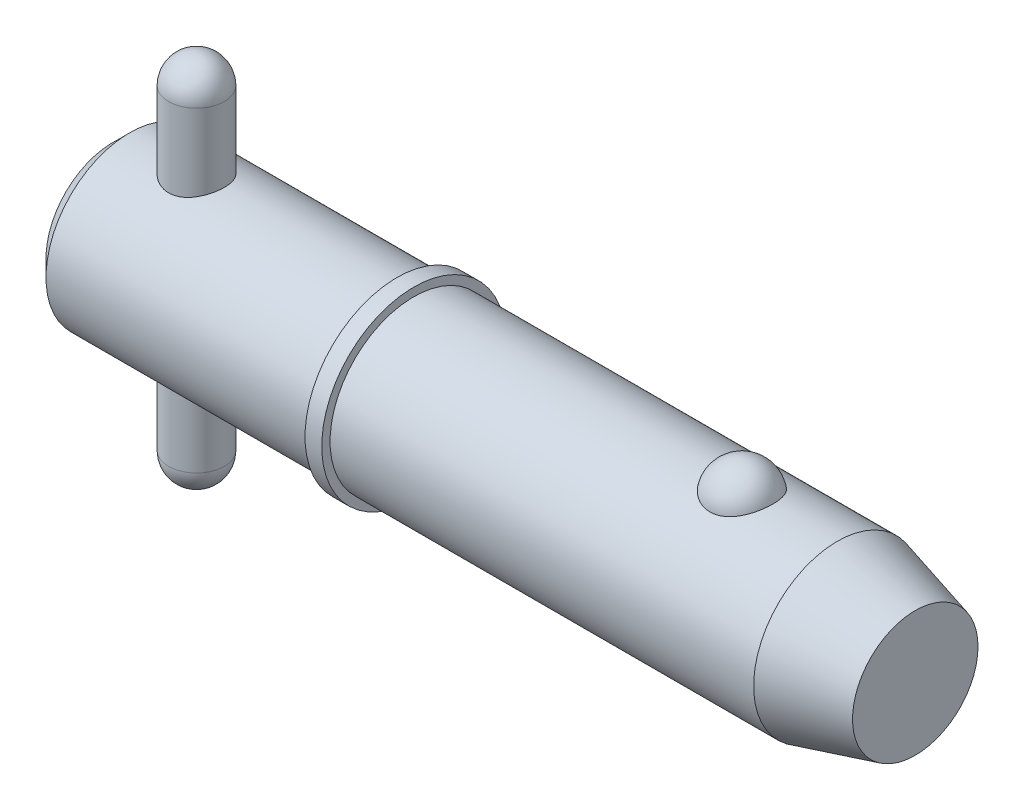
ISO-10303-21;
HEADER;
FILE_DESCRIPTION(('STEP AP214'),'2;1');
FILE_NAME('part.step','',(''),(''),'','','');
FILE_SCHEMA(('AUTOMOTIVE_DESIGN { 1 0 10303 214 1 1 1 1 }'));
ENDSEC;
DATA;
#1=APPLICATION_CONTEXT('core data for automotive mechanical design processes');
#2=APPLICATION_PROTOCOL_DEFINITION('international standard','automotive_design',2000,#1);
#3=PRODUCT_CONTEXT('',#1,'mechanical');
#4=PRODUCT('Part','Part','',(#3));
#5=PRODUCT_RELATED_PRODUCT_CATEGORY('part','',(#4));
#6=PRODUCT_DEFINITION_FORMATION('','',#4);
#7=PRODUCT_DEFINITION_CONTEXT('part definition',#1,'design');
#8=PRODUCT_DEFINITION('design','',#6,#7);
#9=PRODUCT_DEFINITION_SHAPE('','',#8);
#10=(LENGTH_UNIT() NAMED_UNIT(*) SI_UNIT(.MILLI.,.METRE.));
#11=(NAMED_UNIT(*) PLANE_ANGLE_UNIT() SI_UNIT($,.RADIAN.));
#12=(NAMED_UNIT(*) SI_UNIT($,.STERADIAN.) SOLID_ANGLE_UNIT());
#13=UNCERTAINTY_MEASURE_WITH_UNIT(LENGTH_MEASURE(1.E-05),#10,'distance_accuracy_value','');
#14=(GEOMETRIC_REPRESENTATION_CONTEXT(3) GLOBAL_UNCERTAINTY_ASSIGNED_CONTEXT((#13)) GLOBAL_UNIT_ASSIGNED_CONTEXT((#10,
#11,#12)) REPRESENTATION_CONTEXT('',''));
#15=CARTESIAN_POINT('',(0.,0.,0.));
#16=DIRECTION('',(0.,0.,1.));
#17=DIRECTION('',(1.,0.,0.));
#18=AXIS2_PLACEMENT_3D('',#15,#16,#17);
#19=CARTESIAN_POINT('',(7.14,15.875,0.));
#20=DIRECTION('',(0.,-1.,0.));
#21=DIRECTION('',(0.,0.,-1.));
#22=AXIS2_PLACEMENT_3D('',#19,#20,#21);
#23=CYLINDRICAL_SURFACE('',#22,2.38);
#24=CARTESIAN_POINT('',(7.14,-13.495,0.));
#25=DIRECTION('',(0.,-1.,0.));
#26=DIRECTION('',(0.,0.,-1.));
#27=AXIS2_PLACEMENT_3D('',#24,#25,#26);
#28=CIRCLE('',#27,2.38);
#29=CARTESIAN_POINT('',(7.14,-13.495,-2.38));
#30=VERTEX_POINT('',#29);
#31=EDGE_CURVE('P0_E10',#30,#30,#28,.F.);
#32=ORIENTED_EDGE('',*,*,#31,.T.);
#33=EDGE_LOOP('',(#32));
#34=FACE_BOUND('',#33,.T.);
#35=CARTESIAN_POINT('',(7.14,13.495,0.));
#36=DIRECTION('',(0.,-1.,0.));
#37=DIRECTION('',(0.,0.,-1.));
#38=AXIS2_PLACEMENT_3D('',#35,#36,#37);
#39=CIRCLE('',#38,2.38);
#40=CARTESIAN_POINT('',(7.14,13.495,-2.38));
#41=VERTEX_POINT('',#40);
#42=EDGE_CURVE('P0_E21',#41,#41,#39,.T.);
#43=ORIENTED_EDGE('',*,*,#42,.T.);
#44=EDGE_LOOP('',(#43));
#45=FACE_BOUND('',#44,.T.);
#46=ADVANCED_FACE('P0_F14',(#34,#45),#23,.T.);
#47=CARTESIAN_POINT('',(7.14,-13.495,0.));
#48=DIRECTION('',(0.,0.,1.));
#49=DIRECTION('',(1.,0.,0.));
#50=AXIS2_PLACEMENT_3D('',#47,#48,#49);
#51=SPHERICAL_SURFACE('',#50,2.38);
#52=CARTESIAN_POINT('',(7.14,-13.495,0.));
#53=DIRECTION('',(0.,-1.,0.));
#54=DIRECTION('',(0.,0.,-1.));
#55=AXIS2_PLACEMENT_3D('',#52,#53,#54);
#56=SPHERICAL_SURFACE('',#55,2.38);
#57=ORIENTED_EDGE('',*,*,#31,.F.);
#58=EDGE_LOOP('',(#57));
#59=FACE_BOUND('',#58,.T.);
#60=ADVANCED_FACE('P0_F29',(#59),#56,.T.);
#61=CARTESIAN_POINT('',(7.14,13.495,0.));
#62=DIRECTION('',(0.,0.,1.));
#63=DIRECTION('',(1.,0.,0.));
#64=AXIS2_PLACEMENT_3D('',#61,#62,#63);
#65=SPHERICAL_SURFACE('',#64,2.38);
#66=CARTESIAN_POINT('',(7.14,13.495,0.));
#67=DIRECTION('',(0.,-1.,0.));
#68=DIRECTION('',(0.,0.,-1.));
#69=AXIS2_PLACEMENT_3D('',#66,#67,#68);
#70=SPHERICAL_SURFACE('',#69,2.38);
#71=ORIENTED_EDGE('',*,*,#42,.F.);
#72=EDGE_LOOP('',(#71));
#73=FACE_BOUND('',#72,.T.);
#74=ADVANCED_FACE('P0_F16',(#73),#70,.T.);
#75=CLOSED_SHELL('',(#46,#60,#74));
#76=MANIFOLD_SOLID_BREP('P0_B1',#75);
#77=CARTESIAN_POINT('',(0.,0.,0.));
#78=DIRECTION('',(1.,0.,0.));
#79=DIRECTION('',(0.,0.,-1.));
#80=AXIS2_PLACEMENT_3D('',#77,#78,#79);
#81=CYLINDRICAL_SURFACE('',#80,7.145);
#82=CARTESIAN_POINT('',(61.8836242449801,0.,0.));
#83=DIRECTION('',(1.,0.,0.));
#84=DIRECTION('',(0.,0.,-1.));
#85=AXIS2_PLACEMENT_3D('',#82,#83,#84);
#86=CIRCLE('',#85,7.145);
#87=CARTESIAN_POINT('',(61.8836242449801,0.,-7.145));
#88=VERTEX_POINT('',#87);
#89=EDGE_CURVE('P1_E81',#88,#88,#86,.T.);
#90=ORIENTED_EDGE('',*,*,#89,.F.);
#91=EDGE_LOOP('',(#90));
#92=FACE_BOUND('',#91,.T.);
#93=CARTESIAN_POINT('',(25.7,0.,0.));
#94=DIRECTION('',(1.,0.,0.));
#95=DIRECTION('',(0.,0.,-1.));
#96=AXIS2_PLACEMENT_3D('',#93,#94,#95);
#97=CIRCLE('',#96,7.145);
#98=CARTESIAN_POINT('',(25.7,0.,-7.145));
#99=VERTEX_POINT('',#98);
#100=EDGE_CURVE('P1_E85',#99,#99,#97,.T.);
#101=ORIENTED_EDGE('',*,*,#100,.T.);
#102=EDGE_LOOP('',(#101));
#103=FACE_BOUND('',#102,.T.);
#104=CARTESIAN_POINT('',(53.7395037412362,6.60328629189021,2.72903557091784));
#105=CARTESIAN_POINT('',(53.5983158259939,6.60329644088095,2.7290249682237));
#106=CARTESIAN_POINT('',(53.4568832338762,6.60799490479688,2.71772840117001));
#107=CARTESIAN_POINT('',(53.1779557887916,6.62628236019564,2.6728193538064));
#108=CARTESIAN_POINT('',(53.0404726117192,6.63989534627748,2.63914664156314));
#109=CARTESIAN_POINT('',(52.7738894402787,6.67440775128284,2.55059642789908));
#110=CARTESIAN_POINT('',(52.6447683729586,6.69528793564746,2.49577486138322));
#111=CARTESIAN_POINT('',(52.3978694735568,6.74205585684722,2.36651799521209));
#112=CARTESIAN_POINT('',(52.2800865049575,6.76794130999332,2.29209163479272));
#113=CARTESIAN_POINT('',(52.0551671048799,6.82286177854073,2.12312937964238));
#114=CARTESIAN_POINT('',(51.9484405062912,6.85196655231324,2.02807107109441));
#115=CARTESIAN_POINT('',(51.7519181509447,6.90970232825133,1.82167822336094));
#116=CARTESIAN_POINT('',(51.6621276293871,6.93833318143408,1.71033867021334));
#117=CARTESIAN_POINT('',(51.4976670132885,6.9935167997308,1.46891951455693));
#118=CARTESIAN_POINT('',(51.423844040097,7.01992110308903,1.33822781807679));
#119=CARTESIAN_POINT('',(51.2980884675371,7.06643385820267,1.0656656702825));
#120=CARTESIAN_POINT('',(51.2461573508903,7.08654188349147,0.923794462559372));
#121=CARTESIAN_POINT('',(51.1647323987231,7.11862399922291,0.630993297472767));
#122=CARTESIAN_POINT('',(51.1355167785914,7.13049704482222,0.479974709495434));
#123=CARTESIAN_POINT('',(51.1011742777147,7.14449484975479,0.174782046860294));
#124=CARTESIAN_POINT('',(51.0960466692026,7.14661990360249,0.0206080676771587));
#125=CARTESIAN_POINT('',(51.109938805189,7.14092465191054,-0.285506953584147));
#126=CARTESIAN_POINT('',(51.1288101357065,7.1331654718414,-0.437455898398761));
#127=CARTESIAN_POINT('',(51.1900622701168,7.10859076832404,-0.735778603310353));
#128=CARTESIAN_POINT('',(51.2324435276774,7.0917750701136,-0.882152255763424));
#129=CARTESIAN_POINT('',(51.3399346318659,7.05076716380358,-1.165431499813));
#130=CARTESIAN_POINT('',(51.4050759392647,7.02656475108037,-1.30232366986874));
#131=CARTESIAN_POINT('',(51.5567597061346,6.97329145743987,-1.56265907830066));
#132=CARTESIAN_POINT('',(51.643303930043,6.94422017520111,-1.68610120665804));
#133=CARTESIAN_POINT('',(51.8364654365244,6.88415108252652,-1.91671004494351));
#134=CARTESIAN_POINT('',(51.9431807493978,6.85314438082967,-2.02379244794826));
#135=CARTESIAN_POINT('',(52.1739740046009,6.79282069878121,-2.21787433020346));
#136=CARTESIAN_POINT('',(52.2980505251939,6.76350358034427,-2.30487545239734));
#137=CARTESIAN_POINT('',(52.5576784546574,6.71060580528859,-2.45458647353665));
#138=CARTESIAN_POINT('',(52.6929387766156,6.68691885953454,-2.51776240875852));
#139=CARTESIAN_POINT('',(52.9732778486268,6.64741247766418,-2.62030218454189));
#140=CARTESIAN_POINT('',(53.1183528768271,6.63159007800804,-2.65967499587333));
#141=CARTESIAN_POINT('',(53.4063475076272,6.61038594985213,-2.71193301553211));
#142=CARTESIAN_POINT('',(53.5490080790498,6.60451880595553,-2.72605165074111));
#143=CARTESIAN_POINT('',(53.8348004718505,6.60240611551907,-2.73116688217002));
#144=CARTESIAN_POINT('',(53.9779321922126,6.60615862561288,-2.72216814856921));
#145=CARTESIAN_POINT('',(54.2558486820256,6.6225609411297,-2.68200435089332));
#146=CARTESIAN_POINT('',(54.3907542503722,6.63492533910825,-2.65154998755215));
#147=CARTESIAN_POINT('',(54.65332009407,6.66687445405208,-2.57015684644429));
#148=CARTESIAN_POINT('',(54.7809797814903,6.68645975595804,-2.51921640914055));
#149=CARTESIAN_POINT('',(55.0285777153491,6.73127274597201,-2.39693610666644));
#150=CARTESIAN_POINT('',(55.148287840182,6.7566138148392,-2.32517694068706));
#151=CARTESIAN_POINT('',(55.3741592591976,6.8100600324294,-2.16363812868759));
#152=CARTESIAN_POINT('',(55.480317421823,6.83816581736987,-2.07385432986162));
#153=CARTESIAN_POINT('',(55.6818620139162,6.89580469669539,-1.87357235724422));
#154=CARTESIAN_POINT('',(55.776440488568,6.92533863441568,-1.76226074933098));
#155=CARTESIAN_POINT('',(55.9463329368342,6.98139526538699,-1.52511696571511));
#156=CARTESIAN_POINT('',(56.0216434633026,7.0079174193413,-1.39928219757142));
#157=CARTESIAN_POINT('',(56.153595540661,7.05607625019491,-1.1321597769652));
#158=CARTESIAN_POINT('',(56.2095688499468,7.07753119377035,-0.990508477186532));
#159=CARTESIAN_POINT('',(56.2982965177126,7.11222355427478,-0.699154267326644));
#160=CARTESIAN_POINT('',(56.3310506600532,7.12546089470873,-0.549451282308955));
#161=CARTESIAN_POINT('',(56.3726899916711,7.14237584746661,-0.246120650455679));
#162=CARTESIAN_POINT('',(56.381558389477,7.14604673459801,-0.0924903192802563));
#163=CARTESIAN_POINT('',(56.3751940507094,7.14343510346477,0.214181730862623));
#164=CARTESIAN_POINT('',(56.3599618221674,7.13715279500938,0.367223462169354));
#165=CARTESIAN_POINT('',(56.3058451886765,7.1153294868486,0.667595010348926));
#166=CARTESIAN_POINT('',(56.2670776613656,7.09983424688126,0.814949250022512));
#167=CARTESIAN_POINT('',(56.1667700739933,7.06119140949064,1.10063221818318));
#168=CARTESIAN_POINT('',(56.1052284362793,7.03804328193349,1.238960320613));
#169=CARTESIAN_POINT('',(55.9602071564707,6.98632429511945,1.50352300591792));
#170=CARTESIAN_POINT('',(55.8766067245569,6.95772382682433,1.62968561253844));
#171=CARTESIAN_POINT('',(55.6893804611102,6.89823072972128,1.86554304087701));
#172=CARTESIAN_POINT('',(55.5857557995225,6.86733823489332,1.97523882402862));
#173=CARTESIAN_POINT('',(55.3610769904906,6.80676456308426,2.17482293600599));
#174=CARTESIAN_POINT('',(55.2400673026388,6.7770805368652,2.26476035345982));
#175=CARTESIAN_POINT('',(54.9833408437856,6.7223050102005,2.42252989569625));
#176=CARTESIAN_POINT('',(54.84761851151,6.69721525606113,2.49035362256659));
#177=CARTESIAN_POINT('',(54.5704022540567,6.65552591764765,2.59967646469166));
#178=CARTESIAN_POINT('',(54.4292810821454,6.63865794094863,2.64202017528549));
#179=CARTESIAN_POINT('',(54.1414448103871,6.61425039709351,2.7025584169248));
#180=CARTESIAN_POINT('',(53.9947480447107,6.606682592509,2.72082606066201));
#181=CARTESIAN_POINT('',(53.8116799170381,6.60358754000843,2.72830331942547));
#182=CARTESIAN_POINT('',(53.7755998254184,6.60328369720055,2.72903828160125));
#183=CARTESIAN_POINT('',(53.7395037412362,6.60328629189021,2.72903557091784));
#184=B_SPLINE_CURVE_WITH_KNOTS('',3,(#104,#105,#106,#107,#108,#109,#110,#111,#112,#113,#114,
#115,#116,#117,#118,#119,#120,#121,#122,#123,#124,#125,#126,#127,#128,#129,#130,#131,#132,#133,
#134,#135,#136,#137,#138,#139,#140,#141,#142,#143,#144,#145,#146,#147,#148,#149,#150,#151,#152,
#153,#154,#155,#156,#157,#158,#159,#160,#161,#162,#163,#164,#165,#166,#167,#168,#169,#170,#171,
#172,#173,#174,#175,#176,#177,#178,#179,#180,#181,#182,#183),.UNSPECIFIED.,.T.,.F.,(4,2,2,2,2,2,
2,2,2,2,2,2,2,2,2,2,2,2,2,2,2,2,2,2,2,2,2,2,2,2,2,2,2,2,2,2,2,2,2,4),(0.,0.423468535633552,
0.848081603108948,1.27157926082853,1.69488414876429,2.13051395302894,2.56627819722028,
3.02136706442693,3.47648674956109,3.93709649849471,4.39769233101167,4.85545355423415,
5.31322361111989,5.77162895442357,6.23007210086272,6.69080337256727,7.15149693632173,
7.60264329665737,8.05361952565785,8.48189729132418,8.91008854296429,9.32472524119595,
9.73939553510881,10.1630783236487,10.5868588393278,11.0319070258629,11.4770347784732,
11.9362874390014,12.3955443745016,12.8551240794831,13.3146940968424,13.7720003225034,
14.2293382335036,14.6892343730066,15.1491036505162,15.6078171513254,16.0667046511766,
16.5093965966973,16.9507410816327,17.0590049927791),.UNSPECIFIED.);
#185=CARTESIAN_POINT('',(53.7395037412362,6.60328629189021,2.72903557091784));
#186=VERTEX_POINT('',#185);
#187=EDGE_CURVE('P1_E35',#186,#186,#184,.T.);
#188=ORIENTED_EDGE('',*,*,#187,.T.);
#189=EDGE_LOOP('',(#188));
#190=FACE_BOUND('',#189,.T.);
#191=ADVANCED_FACE('P1_F13',(#92,#103,#190),#81,.T.);
#192=CARTESIAN_POINT('',(0.,0.,0.));
#193=DIRECTION('',(-1.,0.,0.));
#194=DIRECTION('',(0.,0.,1.));
#195=AXIS2_PLACEMENT_3D('',#192,#193,#194);
#196=PLANE('',#195);
#197=CARTESIAN_POINT('',(0.,0.,0.));
#198=DIRECTION('',(1.,0.,0.));
#199=DIRECTION('',(0.,0.,-1.));
#200=AXIS2_PLACEMENT_3D('',#197,#198,#199);
#201=CIRCLE('',#200,5.716);
#202=CARTESIAN_POINT('',(0.,0.,-5.716));
#203=VERTEX_POINT('',#202);
#204=EDGE_CURVE('P1_E9',#203,#203,#201,.T.);
#205=ORIENTED_EDGE('',*,*,#204,.F.);
#206=EDGE_LOOP('',(#205));
#207=FACE_BOUND('',#206,.T.);
#208=ADVANCED_FACE('P1_F15',(#207),#196,.T.);
#209=CARTESIAN_POINT('',(1.42899999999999,0.,0.));
#210=DIRECTION('',(1.,0.,0.));
#211=DIRECTION('',(0.,0.,-1.));
#212=AXIS2_PLACEMENT_3D('',#209,#210,#211);
#213=CONICAL_SURFACE('',#212,7.145,0.78539816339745);
#214=ORIENTED_EDGE('',*,*,#204,.T.);
#215=EDGE_LOOP('',(#214));
#216=FACE_BOUND('',#215,.T.);
#217=CARTESIAN_POINT('',(1.42899999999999,0.,0.));
#218=DIRECTION('',(1.,0.,0.));
#219=DIRECTION('',(0.,0.,-1.));
#220=AXIS2_PLACEMENT_3D('',#217,#218,#219);
#221=CIRCLE('',#220,7.145);
#222=CARTESIAN_POINT('',(1.42899999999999,0.,-7.145));
#223=VERTEX_POINT('',#222);
#224=EDGE_CURVE('P1_E26',#223,#223,#221,.T.);
#225=ORIENTED_EDGE('',*,*,#224,.F.);
#226=EDGE_LOOP('',(#225));
#227=FACE_BOUND('',#226,.T.);
#228=ADVANCED_FACE('P1_F77',(#216,#227),#213,.T.);
#229=CARTESIAN_POINT('',(0.,0.,0.));
#230=DIRECTION('',(1.,0.,0.));
#231=DIRECTION('',(0.,0.,-1.));
#232=AXIS2_PLACEMENT_3D('',#229,#230,#231);
#233=CYLINDRICAL_SURFACE('',#232,7.145);
#234=CARTESIAN_POINT('',(7.14,-6.73695962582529,2.38));
#235=CARTESIAN_POINT('',(7.01035997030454,-6.73695921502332,2.38000059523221));
#236=CARTESIAN_POINT('',(6.88072348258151,-6.74074253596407,2.36937183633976));
#237=CARTESIAN_POINT('',(6.62529075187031,-6.75538853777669,2.32728080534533));
#238=CARTESIAN_POINT('',(6.49949514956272,-6.76625239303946,2.29581507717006));
#239=CARTESIAN_POINT('',(6.2554858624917,-6.79369535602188,2.21327763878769));
#240=CARTESIAN_POINT('',(6.13725786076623,-6.81026326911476,2.16224430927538));
#241=CARTESIAN_POINT('',(5.91100349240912,-6.84723128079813,2.04215132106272));
#242=CARTESIAN_POINT('',(5.80297937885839,-6.86763222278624,1.97308769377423));
#243=CARTESIAN_POINT('',(5.59597854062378,-6.91086152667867,1.81600414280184));
#244=CARTESIAN_POINT('',(5.49745861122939,-6.93375032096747,1.72739874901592));
#245=CARTESIAN_POINT('',(5.31636508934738,-6.97886546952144,1.53499636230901));
#246=CARTESIAN_POINT('',(5.23379405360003,-7.00109171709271,1.43119693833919));
#247=CARTESIAN_POINT('',(5.08487013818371,-7.04307708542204,1.20801318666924));
#248=CARTESIAN_POINT('',(5.01899578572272,-7.06275685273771,1.08829330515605));
#249=CARTESIAN_POINT('',(4.90850130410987,-7.09671988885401,0.838703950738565));
#250=CARTESIAN_POINT('',(4.86387545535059,-7.11100460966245,0.70883722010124));
#251=CARTESIAN_POINT('',(4.79869354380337,-7.13213998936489,0.44742990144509));
#252=CARTESIAN_POINT('',(4.77735497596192,-7.13923172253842,0.316104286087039));
#253=CARTESIAN_POINT('',(4.75686536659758,-7.14603777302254,0.0515578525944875));
#254=CARTESIAN_POINT('',(4.75770861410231,-7.14575398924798,-0.0816624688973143));
#255=CARTESIAN_POINT('',(4.78106216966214,-7.13800438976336,-0.340678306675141));
#256=CARTESIAN_POINT('',(4.80272255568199,-7.13082030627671,-0.466560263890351));
#257=CARTESIAN_POINT('',(4.86569013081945,-7.11043095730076,-0.712788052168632));
#258=CARTESIAN_POINT('',(4.90699865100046,-7.09722528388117,-0.833133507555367));
#259=CARTESIAN_POINT('',(5.00858673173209,-7.06591754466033,-1.06673173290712));
#260=CARTESIAN_POINT('',(5.06910834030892,-7.0477534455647,-1.17987058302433));
#261=CARTESIAN_POINT('',(5.20720514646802,-7.00841977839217,-1.39463797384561));
#262=CARTESIAN_POINT('',(5.28478508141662,-6.987249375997,-1.49626330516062));
#263=CARTESIAN_POINT('',(5.4590800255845,-6.94296010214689,-1.69017445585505));
#264=CARTESIAN_POINT('',(5.55652324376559,-6.91979641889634,-1.78179645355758));
#265=CARTESIAN_POINT('',(5.76558873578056,-6.87497076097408,-1.94761348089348));
#266=CARTESIAN_POINT('',(5.87721318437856,-6.85330901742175,-2.02180583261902));
#267=CARTESIAN_POINT('',(6.11357367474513,-6.81369485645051,-2.15157488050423));
#268=CARTESIAN_POINT('',(6.23847358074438,-6.79579956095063,-2.20687188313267));
#269=CARTESIAN_POINT('',(6.49655785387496,-6.76640630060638,-2.29542443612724));
#270=CARTESIAN_POINT('',(6.62973872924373,-6.75490565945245,-2.32868920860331));
#271=CARTESIAN_POINT('',(6.89417536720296,-6.74020933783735,-2.37088225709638));
#272=CARTESIAN_POINT('',(7.02524746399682,-6.73666278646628,-2.38083959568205));
#273=CARTESIAN_POINT('',(7.28721035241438,-6.73729555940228,-2.37904974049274));
#274=CARTESIAN_POINT('',(7.41810117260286,-6.7414734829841,-2.36730648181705));
#275=CARTESIAN_POINT('',(7.67130717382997,-6.75673471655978,-2.32337336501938));
#276=CARTESIAN_POINT('',(7.79376251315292,-6.76757635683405,-2.29189834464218));
#277=CARTESIAN_POINT('',(8.03162917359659,-6.79467771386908,-2.21025275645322));
#278=CARTESIAN_POINT('',(8.14703924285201,-6.8109383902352,-2.16007887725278));
#279=CARTESIAN_POINT('',(8.37159169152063,-6.84768362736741,-2.04065289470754));
#280=CARTESIAN_POINT('',(8.48041962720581,-6.86828569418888,-1.97084668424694));
#281=CARTESIAN_POINT('',(8.68518919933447,-6.91116416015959,-1.8147657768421));
#282=CARTESIAN_POINT('',(8.78112702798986,-6.93344105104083,-1.72848623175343));
#283=CARTESIAN_POINT('',(8.96215574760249,-6.97845348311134,-1.53698616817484));
#284=CARTESIAN_POINT('',(9.04650427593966,-7.00115965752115,-1.43105491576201));
#285=CARTESIAN_POINT('',(9.19627592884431,-7.04341676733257,-1.20598377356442));
#286=CARTESIAN_POINT('',(9.26169972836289,-7.06296781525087,-1.08684435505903));
#287=CARTESIAN_POINT('',(9.37116617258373,-7.0966205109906,-0.83933303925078));
#288=CARTESIAN_POINT('',(9.41534821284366,-7.11075755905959,-0.711027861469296));
#289=CARTESIAN_POINT('',(9.48132660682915,-7.13214194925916,-0.448245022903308));
#290=CARTESIAN_POINT('',(9.50313102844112,-7.13939177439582,-0.313769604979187));
#291=CARTESIAN_POINT('',(9.5230098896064,-7.14599771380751,-0.049254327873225));
#292=CARTESIAN_POINT('',(9.52215013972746,-7.14570837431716,0.0806974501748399));
#293=CARTESIAN_POINT('',(9.49935359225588,-7.13814116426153,0.338518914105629));
#294=CARTESIAN_POINT('',(9.47741850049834,-7.13086385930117,0.466388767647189));
#295=CARTESIAN_POINT('',(9.4138005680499,-7.11026814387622,0.714400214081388));
#296=CARTESIAN_POINT('',(9.37243609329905,-7.09704726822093,0.834632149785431));
#297=CARTESIAN_POINT('',(9.27142829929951,-7.06592602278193,1.06649582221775));
#298=CARTESIAN_POINT('',(9.2117816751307,-7.04802480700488,1.1781259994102));
#299=CARTESIAN_POINT('',(9.07336776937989,-7.00856499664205,1.39411030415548));
#300=CARTESIAN_POINT('',(8.99397590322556,-6.98689577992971,1.49804368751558));
#301=CARTESIAN_POINT('',(8.81938810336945,-6.9426110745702,1.69146078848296));
#302=CARTESIAN_POINT('',(8.72418713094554,-6.91999528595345,1.78093988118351));
#303=CARTESIAN_POINT('',(8.51623540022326,-6.87531507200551,1.94646188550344));
#304=CARTESIAN_POINT('',(8.4029442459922,-6.85330672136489,2.02184316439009));
#305=CARTESIAN_POINT('',(8.16461714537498,-6.81342065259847,2.1524427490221));
#306=CARTESIAN_POINT('',(8.03958429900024,-6.7955418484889,2.20766635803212));
#307=CARTESIAN_POINT('',(7.78712566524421,-6.76686117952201,2.29403636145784));
#308=CARTESIAN_POINT('',(7.66006989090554,-6.75577342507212,2.32616709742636));
#309=CARTESIAN_POINT('',(7.40200728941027,-6.74082409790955,2.36914495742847));
#310=CARTESIAN_POINT('',(7.27100183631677,-6.73696004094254,2.37999939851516));
#311=CARTESIAN_POINT('',(7.14,-6.73695962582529,2.38));
#312=B_SPLINE_CURVE_WITH_KNOTS('',3,(#234,#235,#236,#237,#238,#239,#240,#241,#242,#243,#244,
#245,#246,#247,#248,#249,#250,#251,#252,#253,#254,#255,#256,#257,#258,#259,#260,#261,#262,#263,
#264,#265,#266,#267,#268,#269,#270,#271,#272,#273,#274,#275,#276,#277,#278,#279,#280,#281,#282,
#283,#284,#285,#286,#287,#288,#289,#290,#291,#292,#293,#294,#295,#296,#297,#298,#299,#300,#301,
#302,#303,#304,#305,#306,#307,#308,#309,#310,#311),.UNSPECIFIED.,.T.,.F.,(4,2,2,2,2,2,2,2,2,2,2,
2,2,2,2,2,2,2,2,2,2,2,2,2,2,2,2,2,2,2,2,2,2,2,2,2,2,2,4),(0.,0.388434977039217,
0.776934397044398,1.16467566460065,1.55250234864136,1.9540847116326,2.35573139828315,
2.76784120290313,3.17984001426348,3.57752248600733,3.97510257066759,4.35711073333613,
4.7391447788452,5.12619663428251,5.51335611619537,5.91871976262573,6.3241456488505,
6.73533623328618,7.14635459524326,7.53885245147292,7.93127914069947,8.31025106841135,
8.68929014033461,9.08033871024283,9.47150254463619,9.88145528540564,10.2913934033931,
10.6986033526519,11.1056664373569,11.4936225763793,11.8815473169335,12.2633262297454,
12.645174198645,13.0411187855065,13.437189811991,13.8487371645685,14.2601761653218,
14.6528265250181,15.0453418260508),.UNSPECIFIED.);
#313=CARTESIAN_POINT('',(7.14,-6.73695962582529,2.38));
#314=VERTEX_POINT('',#313);
#315=EDGE_CURVE('P1_E17',#314,#314,#312,.T.);
#316=ORIENTED_EDGE('',*,*,#315,.F.);
#317=EDGE_LOOP('',(#316));
#318=FACE_BOUND('',#317,.T.);
#319=CARTESIAN_POINT('',(7.14,6.73695962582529,2.38));
#320=CARTESIAN_POINT('',(7.26964002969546,6.73695921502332,2.38000059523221));
#321=CARTESIAN_POINT('',(7.39927651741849,6.74074253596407,2.36937183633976));
#322=CARTESIAN_POINT('',(7.65470924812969,6.75538853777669,2.32728080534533));
#323=CARTESIAN_POINT('',(7.78050485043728,6.76625239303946,2.29581507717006));
#324=CARTESIAN_POINT('',(8.02451413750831,6.79369535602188,2.21327763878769));
#325=CARTESIAN_POINT('',(8.14274213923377,6.81026326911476,2.16224430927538));
#326=CARTESIAN_POINT('',(8.36899650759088,6.84723128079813,2.04215132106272));
#327=CARTESIAN_POINT('',(8.47702062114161,6.86763222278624,1.97308769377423));
#328=CARTESIAN_POINT('',(8.68402145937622,6.91086152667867,1.81600414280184));
#329=CARTESIAN_POINT('',(8.78254138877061,6.93375032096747,1.72739874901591));
#330=CARTESIAN_POINT('',(8.96363491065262,6.97886546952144,1.53499636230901));
#331=CARTESIAN_POINT('',(9.04620594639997,7.00109171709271,1.43119693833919));
#332=CARTESIAN_POINT('',(9.19512986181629,7.04307708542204,1.20801318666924));
#333=CARTESIAN_POINT('',(9.26100421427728,7.06275685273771,1.08829330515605));
#334=CARTESIAN_POINT('',(9.37149869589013,7.09671988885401,0.838703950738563));
#335=CARTESIAN_POINT('',(9.41612454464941,7.11100460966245,0.708837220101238));
#336=CARTESIAN_POINT('',(9.48130645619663,7.13213998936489,0.447429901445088));
#337=CARTESIAN_POINT('',(9.50264502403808,7.13923172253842,0.316104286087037));
#338=CARTESIAN_POINT('',(9.52313463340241,7.14603777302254,0.0515578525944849));
#339=CARTESIAN_POINT('',(9.52229138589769,7.14575398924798,-0.0816624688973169));
#340=CARTESIAN_POINT('',(9.49893783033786,7.13800438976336,-0.340678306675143));
#341=CARTESIAN_POINT('',(9.47727744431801,7.13082030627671,-0.466560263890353));
#342=CARTESIAN_POINT('',(9.41430986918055,7.11043095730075,-0.712788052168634));
#343=CARTESIAN_POINT('',(9.37300134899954,7.09722528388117,-0.833133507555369));
#344=CARTESIAN_POINT('',(9.27141326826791,7.06591754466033,-1.06673173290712));
#345=CARTESIAN_POINT('',(9.21089165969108,7.0477534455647,-1.17987058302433));
#346=CARTESIAN_POINT('',(9.07279485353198,7.00841977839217,-1.39463797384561));
#347=CARTESIAN_POINT('',(8.99521491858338,6.987249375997,-1.49626330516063));
#348=CARTESIAN_POINT('',(8.82091997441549,6.94296010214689,-1.69017445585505));
#349=CARTESIAN_POINT('',(8.72347675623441,6.91979641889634,-1.78179645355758));
#350=CARTESIAN_POINT('',(8.51441126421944,6.87497076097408,-1.94761348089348));
#351=CARTESIAN_POINT('',(8.40278681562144,6.85330901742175,-2.02180583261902));
#352=CARTESIAN_POINT('',(8.16642632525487,6.81369485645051,-2.15157488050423));
#353=CARTESIAN_POINT('',(8.04152641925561,6.79579956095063,-2.20687188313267));
#354=CARTESIAN_POINT('',(7.78344214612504,6.76640630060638,-2.29542443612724));
#355=CARTESIAN_POINT('',(7.65026127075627,6.75490565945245,-2.32868920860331));
#356=CARTESIAN_POINT('',(7.38582463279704,6.74020933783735,-2.37088225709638));
#357=CARTESIAN_POINT('',(7.25475253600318,6.73666278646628,-2.38083959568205));
#358=CARTESIAN_POINT('',(6.99278964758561,6.73729555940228,-2.37904974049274));
#359=CARTESIAN_POINT('',(6.86189882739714,6.7414734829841,-2.36730648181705));
#360=CARTESIAN_POINT('',(6.60869282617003,6.75673471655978,-2.32337336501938));
#361=CARTESIAN_POINT('',(6.48623748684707,6.76757635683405,-2.29189834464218));
#362=CARTESIAN_POINT('',(6.2483708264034,6.79467771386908,-2.21025275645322));
#363=CARTESIAN_POINT('',(6.13296075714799,6.8109383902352,-2.16007887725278));
#364=CARTESIAN_POINT('',(5.90840830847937,6.84768362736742,-2.04065289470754));
#365=CARTESIAN_POINT('',(5.79958037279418,6.86828569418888,-1.97084668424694));
#366=CARTESIAN_POINT('',(5.59481080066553,6.91116416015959,-1.8147657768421));
#367=CARTESIAN_POINT('',(5.49887297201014,6.93344105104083,-1.72848623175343));
#368=CARTESIAN_POINT('',(5.31784425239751,6.97845348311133,-1.53698616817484));
#369=CARTESIAN_POINT('',(5.23349572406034,7.00115965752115,-1.43105491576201));
#370=CARTESIAN_POINT('',(5.08372407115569,7.04341676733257,-1.20598377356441));
#371=CARTESIAN_POINT('',(5.01830027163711,7.06296781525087,-1.08684435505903));
#372=CARTESIAN_POINT('',(4.90883382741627,7.0966205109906,-0.839333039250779));
#373=CARTESIAN_POINT('',(4.86465178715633,7.11075755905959,-0.711027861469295));
#374=CARTESIAN_POINT('',(4.79867339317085,7.13214194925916,-0.448245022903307));
#375=CARTESIAN_POINT('',(4.77686897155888,7.13939177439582,-0.313769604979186));
#376=CARTESIAN_POINT('',(4.7569901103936,7.14599771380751,-0.0492543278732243));
#377=CARTESIAN_POINT('',(4.75784986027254,7.14570837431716,0.0806974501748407));
#378=CARTESIAN_POINT('',(4.78064640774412,7.13814116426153,0.33851891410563));
#379=CARTESIAN_POINT('',(4.80258149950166,7.13086385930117,0.46638876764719));
#380=CARTESIAN_POINT('',(4.8661994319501,7.11026814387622,0.714400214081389));
#381=CARTESIAN_POINT('',(4.90756390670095,7.09704726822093,0.834632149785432));
#382=CARTESIAN_POINT('',(5.00857170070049,7.06592602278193,1.06649582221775));
#383=CARTESIAN_POINT('',(5.0682183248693,7.04802480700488,1.1781259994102));
#384=CARTESIAN_POINT('',(5.20663223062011,7.00856499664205,1.39411030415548));
#385=CARTESIAN_POINT('',(5.28602409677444,6.98689577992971,1.49804368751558));
#386=CARTESIAN_POINT('',(5.46061189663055,6.9426110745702,1.69146078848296));
#387=CARTESIAN_POINT('',(5.55581286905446,6.91999528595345,1.78093988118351));
#388=CARTESIAN_POINT('',(5.76376459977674,6.87531507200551,1.94646188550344));
#389=CARTESIAN_POINT('',(5.8770557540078,6.85330672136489,2.02184316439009));
#390=CARTESIAN_POINT('',(6.11538285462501,6.81342065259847,2.1524427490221));
#391=CARTESIAN_POINT('',(6.24041570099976,6.7955418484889,2.20766635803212));
#392=CARTESIAN_POINT('',(6.4928743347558,6.76686117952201,2.29403636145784));
#393=CARTESIAN_POINT('',(6.61993010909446,6.75577342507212,2.32616709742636));
#394=CARTESIAN_POINT('',(6.87799271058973,6.74082409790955,2.36914495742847));
#395=CARTESIAN_POINT('',(7.00899816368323,6.73696004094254,2.37999939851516));
#396=CARTESIAN_POINT('',(7.14,6.73695962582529,2.38));
#397=B_SPLINE_CURVE_WITH_KNOTS('',3,(#319,#320,#321,#322,#323,#324,#325,#326,#327,#328,#329,
#330,#331,#332,#333,#334,#335,#336,#337,#338,#339,#340,#341,#342,#343,#344,#345,#346,#347,#348,
#349,#350,#351,#352,#353,#354,#355,#356,#357,#358,#359,#360,#361,#362,#363,#364,#365,#366,#367,
#368,#369,#370,#371,#372,#373,#374,#375,#376,#377,#378,#379,#380,#381,#382,#383,#384,#385,#386,
#387,#388,#389,#390,#391,#392,#393,#394,#395,#396),.UNSPECIFIED.,.T.,.F.,(4,2,2,2,2,2,2,2,2,2,2,
2,2,2,2,2,2,2,2,2,2,2,2,2,2,2,2,2,2,2,2,2,2,2,2,2,2,2,4),(0.,0.388434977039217,
0.776934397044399,1.16467566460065,1.55250234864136,1.9540847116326,2.35573139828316,
2.76784120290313,3.17984001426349,3.57752248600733,3.97510257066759,4.35711073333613,
4.73914477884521,5.12619663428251,5.51335611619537,5.91871976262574,6.3241456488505,
6.73533623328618,7.14635459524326,7.53885245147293,7.93127914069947,8.31025106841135,
8.68929014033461,9.08033871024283,9.47150254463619,9.88145528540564,10.2913934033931,
10.6986033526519,11.1056664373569,11.4936225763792,11.8815473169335,12.2633262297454,
12.645174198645,13.0411187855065,13.437189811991,13.8487371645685,14.2601761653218,
14.6528265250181,15.0453418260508),.UNSPECIFIED.);
#398=CARTESIAN_POINT('',(7.14,6.73695962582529,2.38));
#399=VERTEX_POINT('',#398);
#400=EDGE_CURVE('P1_E43',#399,#399,#397,.T.);
#401=ORIENTED_EDGE('',*,*,#400,.F.);
#402=EDGE_LOOP('',(#401));
#403=FACE_BOUND('',#402,.T.);
#404=ORIENTED_EDGE('',*,*,#224,.T.);
#405=EDGE_LOOP('',(#404));
#406=FACE_BOUND('',#405,.T.);
#407=CARTESIAN_POINT('',(24.271,0.,0.));
#408=DIRECTION('',(1.,0.,0.));
#409=DIRECTION('',(0.,0.,-1.));
#410=AXIS2_PLACEMENT_3D('',#407,#408,#409);
#411=CIRCLE('',#410,7.145);
#412=CARTESIAN_POINT('',(24.271,0.,-7.145));
#413=VERTEX_POINT('',#412);
#414=EDGE_CURVE('P1_E31',#413,#413,#411,.T.);
#415=ORIENTED_EDGE('',*,*,#414,.F.);
#416=EDGE_LOOP('',(#415));
#417=FACE_BOUND('',#416,.T.);
#418=ADVANCED_FACE('P1_F103',(#318,#403,#406,#417),#233,.T.);
#419=CARTESIAN_POINT('',(24.271,7.145,0.));
#420=DIRECTION('',(-1.,0.,0.));
#421=DIRECTION('',(0.,0.,1.));
#422=AXIS2_PLACEMENT_3D('',#419,#420,#421);
#423=PLANE('',#422);
#424=ORIENTED_EDGE('',*,*,#414,.T.);
#425=EDGE_LOOP('',(#424));
#426=FACE_BOUND('',#425,.T.);
#427=CARTESIAN_POINT('',(24.271,0.,0.));
#428=DIRECTION('',(1.,0.,0.));
#429=DIRECTION('',(0.,0.,-1.));
#430=AXIS2_PLACEMENT_3D('',#427,#428,#429);
#431=CIRCLE('',#430,7.8595);
#432=CARTESIAN_POINT('',(24.271,0.,-7.8595));
#433=VERTEX_POINT('',#432);
#434=EDGE_CURVE('P1_E91',#433,#433,#431,.T.);
#435=ORIENTED_EDGE('',*,*,#434,.F.);
#436=EDGE_LOOP('',(#435));
#437=FACE_BOUND('',#436,.T.);
#438=ADVANCED_FACE('P1_F100',(#426,#437),#423,.T.);
#439=CARTESIAN_POINT('',(0.,0.,0.));
#440=DIRECTION('',(1.,0.,0.));
#441=DIRECTION('',(0.,0.,-1.));
#442=AXIS2_PLACEMENT_3D('',#439,#440,#441);
#443=CYLINDRICAL_SURFACE('',#442,7.8595);
#444=ORIENTED_EDGE('',*,*,#434,.T.);
#445=EDGE_LOOP('',(#444));
#446=FACE_BOUND('',#445,.T.);
#447=CARTESIAN_POINT('',(25.7,0.,0.));
#448=DIRECTION('',(1.,0.,0.));
#449=DIRECTION('',(0.,0.,-1.));
#450=AXIS2_PLACEMENT_3D('',#447,#448,#449);
#451=CIRCLE('',#450,7.8595);
#452=CARTESIAN_POINT('',(25.7,0.,-7.8595));
#453=VERTEX_POINT('',#452);
#454=EDGE_CURVE('P1_E88',#453,#453,#451,.T.);
#455=ORIENTED_EDGE('',*,*,#454,.F.);
#456=EDGE_LOOP('',(#455));
#457=FACE_BOUND('',#456,.T.);
#458=ADVANCED_FACE('P1_F68',(#446,#457),#443,.T.);
#459=CARTESIAN_POINT('',(25.7,7.8595,0.));
#460=DIRECTION('',(1.,0.,0.));
#461=DIRECTION('',(0.,0.,-1.));
#462=AXIS2_PLACEMENT_3D('',#459,#460,#461);
#463=PLANE('',#462);
#464=ORIENTED_EDGE('',*,*,#454,.T.);
#465=EDGE_LOOP('',(#464));
#466=FACE_BOUND('',#465,.T.);
#467=ORIENTED_EDGE('',*,*,#100,.F.);
#468=EDGE_LOOP('',(#467));
#469=FACE_BOUND('',#468,.T.);
#470=ADVANCED_FACE('P1_F62',(#466,#469),#463,.T.);
#471=CARTESIAN_POINT('',(68.55,0.,0.));
#472=DIRECTION('',(-1.,0.,0.));
#473=DIRECTION('',(0.,0.,1.));
#474=AXIS2_PLACEMENT_3D('',#471,#472,#473);
#475=CONICAL_SURFACE('',#474,5.35875000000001,0.26179938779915);
#476=ORIENTED_EDGE('',*,*,#89,.T.);
#477=EDGE_LOOP('',(#476));
#478=FACE_BOUND('',#477,.T.);
#479=CARTESIAN_POINT('',(68.55,0.,0.));
#480=DIRECTION('',(1.,0.,0.));
#481=DIRECTION('',(0.,0.,-1.));
#482=AXIS2_PLACEMENT_3D('',#479,#480,#481);
#483=CIRCLE('',#482,5.35875000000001);
#484=CARTESIAN_POINT('',(68.55,0.,-5.35875000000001));
#485=VERTEX_POINT('',#484);
#486=EDGE_CURVE('P1_E42',#485,#485,#483,.T.);
#487=ORIENTED_EDGE('',*,*,#486,.F.);
#488=EDGE_LOOP('',(#487));
#489=FACE_BOUND('',#488,.T.);
#490=ADVANCED_FACE('P1_F59',(#478,#489),#475,.T.);
#491=CARTESIAN_POINT('',(68.55,5.35875000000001,0.));
#492=DIRECTION('',(1.,0.,0.));
#493=DIRECTION('',(0.,0.,-1.));
#494=AXIS2_PLACEMENT_3D('',#491,#492,#493);
#495=PLANE('',#494);
#496=ORIENTED_EDGE('',*,*,#486,.T.);
#497=EDGE_LOOP('',(#496));
#498=FACE_BOUND('',#497,.T.);
#499=ADVANCED_FACE('P1_F55',(#498),#495,.T.);
#500=CARTESIAN_POINT('',(53.7395037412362,6.4305,0.));
#501=DIRECTION('',(-1.,0.,0.));
#502=DIRECTION('',(0.,-1.,0.));
#503=AXIS2_PLACEMENT_3D('',#500,#501,#502);
#504=SPHERICAL_SURFACE('',#503,2.7345);
#505=ORIENTED_EDGE('',*,*,#187,.F.);
#506=EDGE_LOOP('',(#505));
#507=FACE_BOUND('',#506,.T.);
#508=ADVANCED_FACE('P1_F50',(#507),#504,.T.);
#509=CARTESIAN_POINT('',(7.14,-7.8595,0.));
#510=DIRECTION('',(0.,1.,0.));
#511=DIRECTION('',(0.,0.,1.));
#512=AXIS2_PLACEMENT_3D('',#509,#510,#511);
#513=CYLINDRICAL_SURFACE('',#512,2.38);
#514=ORIENTED_EDGE('',*,*,#315,.T.);
#515=EDGE_LOOP('',(#514));
#516=FACE_BOUND('',#515,.T.);
#517=ORIENTED_EDGE('',*,*,#400,.T.);
#518=EDGE_LOOP('',(#517));
#519=FACE_BOUND('',#518,.T.);
#520=ADVANCED_FACE('P1_F54',(#516,#519),#513,.F.);
#521=CLOSED_SHELL('',(#191,#208,#228,#418,#438,#458,#470,#490,#499,#508,#520));
#522=MANIFOLD_SOLID_BREP('P1_B1',#521);
#523=ADVANCED_BREP_SHAPE_REPRESENTATION('',(#18,#76,#522),#14);
#524=SHAPE_DEFINITION_REPRESENTATION(#9,#523);
ENDSEC;
END-ISO-10303-21;
